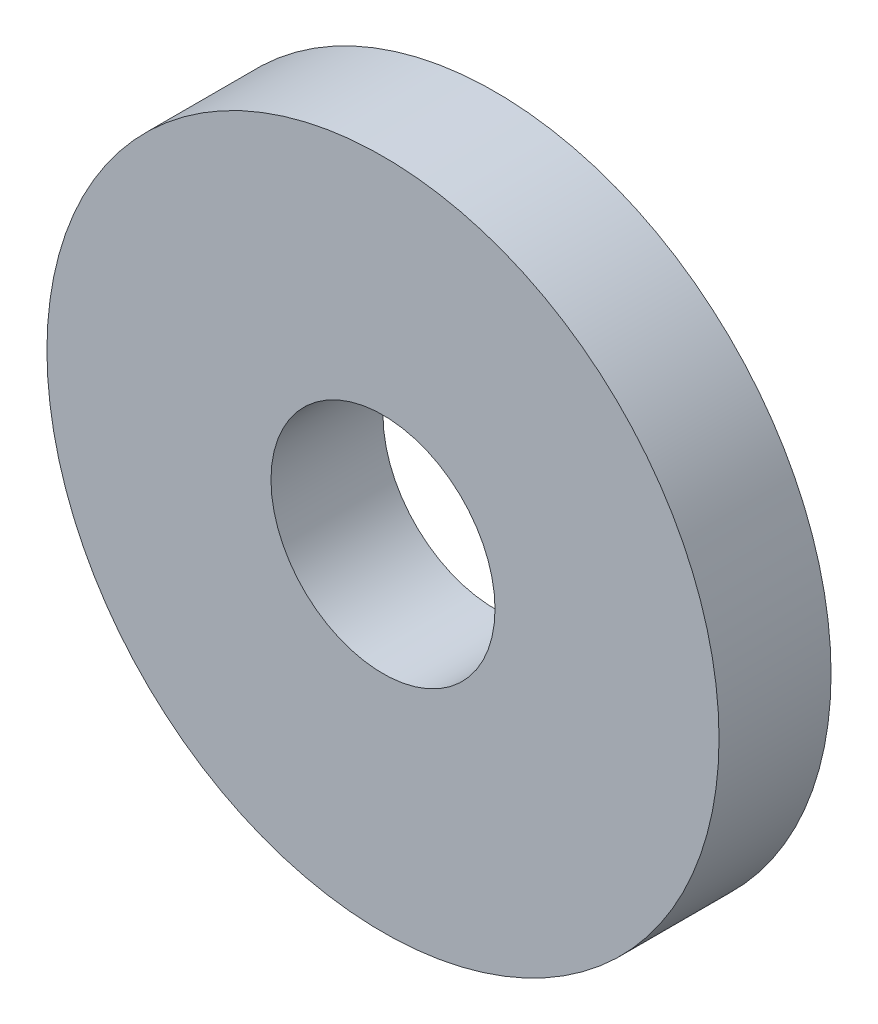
ISO-10303-21;
HEADER;
FILE_DESCRIPTION(('STEP AP214'),'2;1');
FILE_NAME('part.step','',(''),(''),'','','');
FILE_SCHEMA(('AUTOMOTIVE_DESIGN { 1 0 10303 214 1 1 1 1 }'));
ENDSEC;
DATA;
#1=APPLICATION_CONTEXT('core data for automotive mechanical design processes');
#2=APPLICATION_PROTOCOL_DEFINITION('international standard','automotive_design',2000,#1);
#3=PRODUCT_CONTEXT('',#1,'mechanical');
#4=PRODUCT('Part','Part','',(#3));
#5=PRODUCT_RELATED_PRODUCT_CATEGORY('part','',(#4));
#6=PRODUCT_DEFINITION_FORMATION('','',#4);
#7=PRODUCT_DEFINITION_CONTEXT('part definition',#1,'design');
#8=PRODUCT_DEFINITION('design','',#6,#7);
#9=PRODUCT_DEFINITION_SHAPE('','',#8);
#10=(LENGTH_UNIT() NAMED_UNIT(*) SI_UNIT(.MILLI.,.METRE.));
#11=(NAMED_UNIT(*) PLANE_ANGLE_UNIT() SI_UNIT($,.RADIAN.));
#12=(NAMED_UNIT(*) SI_UNIT($,.STERADIAN.) SOLID_ANGLE_UNIT());
#13=UNCERTAINTY_MEASURE_WITH_UNIT(LENGTH_MEASURE(1.E-05),#10,'distance_accuracy_value','');
#14=(GEOMETRIC_REPRESENTATION_CONTEXT(3) GLOBAL_UNCERTAINTY_ASSIGNED_CONTEXT((#13)) GLOBAL_UNIT_ASSIGNED_CONTEXT((#10,
#11,#12)) REPRESENTATION_CONTEXT('',''));
#15=CARTESIAN_POINT('',(0.,0.,0.));
#16=DIRECTION('',(0.,0.,1.));
#17=DIRECTION('',(1.,0.,0.));
#18=AXIS2_PLACEMENT_3D('',#15,#16,#17);
#19=CARTESIAN_POINT('',(-51.2844597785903,26.4393976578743,3.175));
#20=DIRECTION('',(0.,0.,1.));
#21=DIRECTION('',(1.,0.,0.));
#22=AXIS2_PLACEMENT_3D('',#19,#20,#21);
#23=PLANE('',#22);
#24=CARTESIAN_POINT('',(-51.2844597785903,26.4393976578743,3.175));
#25=DIRECTION('',(0.,0.,1.));
#26=DIRECTION('',(1.,0.,0.));
#27=AXIS2_PLACEMENT_3D('',#24,#25,#26);
#28=CIRCLE('',#27,9.525);
#29=CARTESIAN_POINT('',(-41.7594597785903,26.4393976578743,3.175));
#30=VERTEX_POINT('',#29);
#31=EDGE_CURVE('E10',#30,#30,#28,.T.);
#32=ORIENTED_EDGE('',*,*,#31,.T.);
#33=EDGE_LOOP('',(#32));
#34=FACE_BOUND('',#33,.T.);
#35=CARTESIAN_POINT('',(-51.2844597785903,26.4393976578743,3.175));
#36=DIRECTION('',(0.,0.,1.));
#37=DIRECTION('',(1.,0.,0.));
#38=AXIS2_PLACEMENT_3D('',#35,#36,#37);
#39=CIRCLE('',#38,3.175);
#40=CARTESIAN_POINT('',(-48.1094597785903,26.4393976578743,3.175));
#41=VERTEX_POINT('',#40);
#42=EDGE_CURVE('E42',#41,#41,#39,.T.);
#43=ORIENTED_EDGE('',*,*,#42,.F.);
#44=EDGE_LOOP('',(#43));
#45=FACE_BOUND('',#44,.T.);
#46=ADVANCED_FACE('F31',(#34,#45),#23,.T.);
#47=CARTESIAN_POINT('',(-51.2844597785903,26.4393976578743,0.));
#48=DIRECTION('',(0.,0.,1.));
#49=DIRECTION('',(1.,0.,0.));
#50=AXIS2_PLACEMENT_3D('',#47,#48,#49);
#51=PLANE('',#50);
#52=CARTESIAN_POINT('',(-51.2844597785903,26.4393976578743,0.));
#53=DIRECTION('',(0.,0.,1.));
#54=DIRECTION('',(1.,0.,0.));
#55=AXIS2_PLACEMENT_3D('',#52,#53,#54);
#56=CIRCLE('',#55,9.525);
#57=CARTESIAN_POINT('',(-41.7594597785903,26.4393976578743,0.));
#58=VERTEX_POINT('',#57);
#59=EDGE_CURVE('E35',#58,#58,#56,.T.);
#60=ORIENTED_EDGE('',*,*,#59,.F.);
#61=EDGE_LOOP('',(#60));
#62=FACE_BOUND('',#61,.T.);
#63=CARTESIAN_POINT('',(-51.2844597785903,26.4393976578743,0.));
#64=DIRECTION('',(0.,0.,1.));
#65=DIRECTION('',(1.,0.,0.));
#66=AXIS2_PLACEMENT_3D('',#63,#64,#65);
#67=CIRCLE('',#66,3.175);
#68=CARTESIAN_POINT('',(-48.1094597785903,26.4393976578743,0.));
#69=VERTEX_POINT('',#68);
#70=EDGE_CURVE('E44',#69,#69,#67,.T.);
#71=ORIENTED_EDGE('',*,*,#70,.T.);
#72=EDGE_LOOP('',(#71));
#73=FACE_BOUND('',#72,.T.);
#74=ADVANCED_FACE('F54',(#62,#73),#51,.F.);
#75=CARTESIAN_POINT('',(-51.2844597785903,26.4393976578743,3.175));
#76=DIRECTION('',(0.,0.,-1.));
#77=DIRECTION('',(-1.,0.,0.));
#78=AXIS2_PLACEMENT_3D('',#75,#76,#77);
#79=CYLINDRICAL_SURFACE('',#78,9.525);
#80=ORIENTED_EDGE('',*,*,#31,.F.);
#81=EDGE_LOOP('',(#80));
#82=FACE_BOUND('',#81,.T.);
#83=ORIENTED_EDGE('',*,*,#59,.T.);
#84=EDGE_LOOP('',(#83));
#85=FACE_BOUND('',#84,.T.);
#86=ADVANCED_FACE('F33',(#82,#85),#79,.T.);
#87=CARTESIAN_POINT('',(-51.2844597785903,26.4393976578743,3.175));
#88=DIRECTION('',(0.,0.,-1.));
#89=DIRECTION('',(-1.,0.,0.));
#90=AXIS2_PLACEMENT_3D('',#87,#88,#89);
#91=CYLINDRICAL_SURFACE('',#90,3.175);
#92=ORIENTED_EDGE('',*,*,#42,.T.);
#93=EDGE_LOOP('',(#92));
#94=FACE_BOUND('',#93,.T.);
#95=ORIENTED_EDGE('',*,*,#70,.F.);
#96=EDGE_LOOP('',(#95));
#97=FACE_BOUND('',#96,.T.);
#98=ADVANCED_FACE('F50',(#94,#97),#91,.F.);
#99=CLOSED_SHELL('',(#46,#74,#86,#98));
#100=MANIFOLD_SOLID_BREP('B2',#99);
#101=ADVANCED_BREP_SHAPE_REPRESENTATION('',(#18,#100),#14);
#102=SHAPE_DEFINITION_REPRESENTATION(#9,#101);
ENDSEC;
END-ISO-10303-21;
